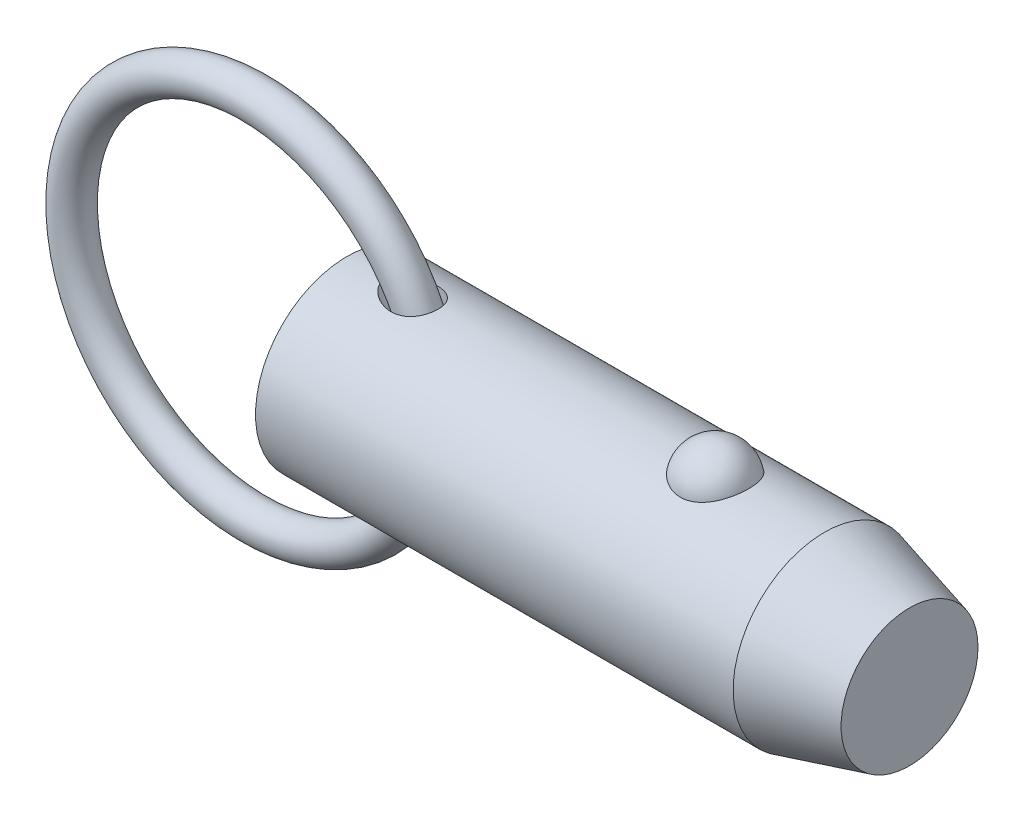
ISO-10303-21;
HEADER;
FILE_DESCRIPTION(('STEP AP214'),'2;1');
FILE_NAME('part.step','',(''),(''),'','','');
FILE_SCHEMA(('AUTOMOTIVE_DESIGN { 1 0 10303 214 1 1 1 1 }'));
ENDSEC;
DATA;
#1=APPLICATION_CONTEXT('core data for automotive mechanical design processes');
#2=APPLICATION_PROTOCOL_DEFINITION('international standard','automotive_design',2000,#1);
#3=PRODUCT_CONTEXT('',#1,'mechanical');
#4=PRODUCT('Part','Part','',(#3));
#5=PRODUCT_RELATED_PRODUCT_CATEGORY('part','',(#4));
#6=PRODUCT_DEFINITION_FORMATION('','',#4);
#7=PRODUCT_DEFINITION_CONTEXT('part definition',#1,'design');
#8=PRODUCT_DEFINITION('design','',#6,#7);
#9=PRODUCT_DEFINITION_SHAPE('','',#8);
#10=(LENGTH_UNIT() NAMED_UNIT(*) SI_UNIT(.MILLI.,.METRE.));
#11=(NAMED_UNIT(*) PLANE_ANGLE_UNIT() SI_UNIT($,.RADIAN.));
#12=(NAMED_UNIT(*) SI_UNIT($,.STERADIAN.) SOLID_ANGLE_UNIT());
#13=UNCERTAINTY_MEASURE_WITH_UNIT(LENGTH_MEASURE(1.E-05),#10,'distance_accuracy_value','');
#14=(GEOMETRIC_REPRESENTATION_CONTEXT(3) GLOBAL_UNCERTAINTY_ASSIGNED_CONTEXT((#13)) GLOBAL_UNIT_ASSIGNED_CONTEXT((#10,
#11,#12)) REPRESENTATION_CONTEXT('',''));
#15=CARTESIAN_POINT('',(0.,0.,0.));
#16=DIRECTION('',(0.,0.,1.));
#17=DIRECTION('',(1.,0.,0.));
#18=AXIS2_PLACEMENT_3D('',#15,#16,#17);
#19=CARTESIAN_POINT('',(-9.66825126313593,0.,0.));
#20=DIRECTION('',(0.,0.,1.));
#21=DIRECTION('',(1.,0.,0.));
#22=AXIS2_PLACEMENT_3D('',#19,#20,#21);
#23=TOROIDAL_SURFACE('',#22,19.05,1.905);
#24=CARTESIAN_POINT('',(11.2867487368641,0.,0.));
#25=VERTEX_POINT('',#24);
#26=VERTEX_LOOP('',#25);
#27=FACE_BOUND('',#26,.T.);
#28=ADVANCED_FACE('P0_F12',(#27),#23,.T.);
#29=CLOSED_SHELL('',(#28));
#30=MANIFOLD_SOLID_BREP('P0_B1',#29);
#31=CARTESIAN_POINT('',(0.,0.,0.));
#32=DIRECTION('',(1.,0.,0.));
#33=DIRECTION('',(0.,0.,-1.));
#34=AXIS2_PLACEMENT_3D('',#31,#32,#33);
#35=CYLINDRICAL_SURFACE('',#34,9.525);
#36=CARTESIAN_POINT('',(4.56693409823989,9.4314194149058,-1.33189820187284));
#37=CARTESIAN_POINT('',(4.70260475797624,9.41020313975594,-1.48215931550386));
#38=CARTESIAN_POINT('',(4.85555680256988,9.38755003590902,-1.61683982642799));
#39=CARTESIAN_POINT('',(5.10171959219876,9.35450554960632,-1.79512943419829));
#40=CARTESIAN_POINT('',(5.18674514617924,9.34362629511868,-1.85068909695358));
#41=CARTESIAN_POINT('',(5.36154389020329,9.32258514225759,-1.95392002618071));
#42=CARTESIAN_POINT('',(5.45131542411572,9.31242299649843,-2.00159402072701));
#43=CARTESIAN_POINT('',(5.70070211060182,9.28632120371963,-2.12033289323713));
#44=CARTESIAN_POINT('',(5.86420408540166,9.27146938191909,-2.18362944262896));
#45=CARTESIAN_POINT('',(6.19893345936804,9.24694163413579,-2.28525783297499));
#46=CARTESIAN_POINT('',(6.3701538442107,9.23726110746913,-2.32361187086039));
#47=CARTESIAN_POINT('',(6.73531776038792,9.22400982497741,-2.37575048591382));
#48=CARTESIAN_POINT('',(6.92975826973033,9.22118808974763,-2.38652934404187));
#49=CARTESIAN_POINT('',(7.21995443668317,9.22416297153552,-2.37494980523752));
#50=CARTESIAN_POINT('',(7.31643847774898,9.22635560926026,-2.366466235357));
#51=CARTESIAN_POINT('',(7.50796421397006,9.2331428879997,-2.33985028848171));
#52=CARTESIAN_POINT('',(7.60300650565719,9.23773650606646,-2.32172202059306));
#53=CARTESIAN_POINT('',(7.83273114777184,9.25183311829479,-2.26504721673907));
#54=CARTESIAN_POINT('',(7.96603028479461,9.26261470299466,-2.2209856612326));
#55=CARTESIAN_POINT('',(8.22310899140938,9.28816519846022,-2.1115730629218));
#56=CARTESIAN_POINT('',(8.34689477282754,9.30293147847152,-2.04623606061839));
#57=CARTESIAN_POINT('',(8.58136049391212,9.3349416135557,-1.89485344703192));
#58=CARTESIAN_POINT('',(8.69199721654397,9.35219324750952,-1.8087422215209));
#59=CARTESIAN_POINT('',(8.89592093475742,9.38707016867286,-1.6179918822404));
#60=CARTESIAN_POINT('',(8.98920771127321,9.40469546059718,-1.51335253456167));
#61=CARTESIAN_POINT('',(9.15057731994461,9.43713590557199,-1.29519427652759));
#62=CARTESIAN_POINT('',(9.21980158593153,9.45205440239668,-1.18253282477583));
#63=CARTESIAN_POINT('',(9.33826736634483,9.47856708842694,-0.946802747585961));
#64=CARTESIAN_POINT('',(9.38751161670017,9.49016173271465,-0.823735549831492));
#65=CARTESIAN_POINT('',(9.46423850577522,9.50859378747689,-0.572614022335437));
#66=CARTESIAN_POINT('',(9.4920239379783,9.5154972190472,-0.444656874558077));
#67=CARTESIAN_POINT('',(9.52636926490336,9.5240690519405,-0.185752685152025));
#68=CARTESIAN_POINT('',(9.5329292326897,9.52573747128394,-0.054805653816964));
#69=CARTESIAN_POINT('',(9.52467276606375,9.52365852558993,0.206503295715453));
#70=CARTESIAN_POINT('',(9.50983454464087,9.51990564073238,0.336864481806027));
#71=CARTESIAN_POINT('',(9.45907362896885,9.50737852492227,0.593166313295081));
#72=CARTESIAN_POINT('',(9.42315106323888,9.49860432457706,0.719106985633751));
#73=CARTESIAN_POINT('',(9.3310664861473,9.4769892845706,0.962959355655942));
#74=CARTESIAN_POINT('',(9.27490839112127,9.46414923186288,1.08087260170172));
#75=CARTESIAN_POINT('',(9.1437580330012,9.43581000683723,1.30534632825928));
#76=CARTESIAN_POINT('',(9.06876720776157,9.42031103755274,1.41190767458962));
#77=CARTESIAN_POINT('',(8.90203187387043,9.38836719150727,1.61069439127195));
#78=CARTESIAN_POINT('',(8.81029913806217,9.371922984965,1.70292975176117));
#79=CARTESIAN_POINT('',(8.6126877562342,9.33985045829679,1.87086859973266));
#80=CARTESIAN_POINT('',(8.50680947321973,9.3242221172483,1.94657251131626));
#81=CARTESIAN_POINT('',(8.28220546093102,9.29513431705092,2.08109032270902));
#82=CARTESIAN_POINT('',(8.16329919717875,9.28171415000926,2.13961034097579));
#83=CARTESIAN_POINT('',(7.91756052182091,9.25859072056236,2.23755716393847));
#84=CARTESIAN_POINT('',(7.79072606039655,9.24888842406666,2.27697900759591));
#85=CARTESIAN_POINT('',(7.52377913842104,9.23338749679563,2.33907806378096));
#86=CARTESIAN_POINT('',(7.3833476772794,9.22789571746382,2.36044900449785));
#87=CARTESIAN_POINT('',(7.1008139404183,9.22210229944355,2.3829751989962));
#88=CARTESIAN_POINT('',(6.95871103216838,9.22180269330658,2.38412253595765));
#89=CARTESIAN_POINT('',(6.65642691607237,9.22632724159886,2.36656230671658));
#90=CARTESIAN_POINT('',(6.49641694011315,9.23185415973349,2.3451317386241));
#91=CARTESIAN_POINT('',(6.18115433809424,9.24811737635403,2.28014143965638));
#92=CARTESIAN_POINT('',(6.02590710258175,9.25885936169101,2.23655754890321));
#93=CARTESIAN_POINT('',(5.69904720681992,9.28624254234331,2.12025087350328));
#94=CARTESIAN_POINT('',(5.52873601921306,9.30354853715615,2.04400672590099));
#95=CARTESIAN_POINT('',(5.20289495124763,9.34106989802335,1.86504730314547));
#96=CARTESIAN_POINT('',(5.0473596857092,9.36128419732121,1.76234172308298));
#97=CARTESIAN_POINT('',(4.79287124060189,9.39697639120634,1.55895334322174));
#98=CARTESIAN_POINT('',(4.6893870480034,9.41240250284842,1.46392900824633));
#99=CARTESIAN_POINT('',(4.4984714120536,9.44202586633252,1.25875918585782));
#100=CARTESIAN_POINT('',(4.41101129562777,9.45622528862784,1.1486413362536));
#101=CARTESIAN_POINT('',(4.27502257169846,9.47888210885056,0.94060098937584));
#102=CARTESIAN_POINT('',(4.22216329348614,9.48791121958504,0.845586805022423));
#103=CARTESIAN_POINT('',(4.13241478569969,9.50344321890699,0.648051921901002));
#104=CARTESIAN_POINT('',(4.09551182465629,9.50994827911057,0.545537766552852));
#105=CARTESIAN_POINT('',(4.04043124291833,9.51971586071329,0.334452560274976));
#106=CARTESIAN_POINT('',(4.0224072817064,9.52295176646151,0.225839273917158));
#107=CARTESIAN_POINT('',(4.00750873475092,9.52562364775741,0.00713006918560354));
#108=CARTESIAN_POINT('',(4.01062334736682,9.52506156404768,-0.102965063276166));
#109=CARTESIAN_POINT('',(4.03592967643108,9.52053221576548,-0.306944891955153));
#110=CARTESIAN_POINT('',(4.05571676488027,9.51699426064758,-0.401151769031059));
#111=CARTESIAN_POINT('',(4.10967975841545,9.5074546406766,-0.585176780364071));
#112=CARTESIAN_POINT('',(4.14385995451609,9.50145224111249,-0.674993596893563));
#113=CARTESIAN_POINT('',(4.23261356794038,9.48611703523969,-0.866116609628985));
#114=CARTESIAN_POINT('',(4.28990016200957,9.47635800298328,-0.966121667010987));
#115=CARTESIAN_POINT('',(4.4185657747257,9.45502867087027,-1.15640011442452));
#116=CARTESIAN_POINT('',(4.48996918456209,9.44345524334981,-1.24665623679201));
#117=CARTESIAN_POINT('',(4.56693409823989,9.4314194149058,-1.33189820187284));
#118=B_SPLINE_CURVE_WITH_KNOTS('',3,(#36,#37,#38,#39,#40,#41,#42,#43,#44,#45,#46,#47,#48,#49,
#50,#51,#52,#53,#54,#55,#56,#57,#58,#59,#60,#61,#62,#63,#64,#65,#66,#67,#68,#69,#70,#71,#72,#73,
#74,#75,#76,#77,#78,#79,#80,#81,#82,#83,#84,#85,#86,#87,#88,#89,#90,#91,#92,#93,#94,#95,#96,#97,
#98,#99,#100,#101,#102,#103,#104,#105,#106,#107,#108,#109,#110,#111,#112,#113,#114,#115,#116,
#117),.UNSPECIFIED.,.T.,.F.,(4,2,2,2,2,2,2,2,2,2,2,2,2,2,2,2,2,2,2,2,2,2,2,2,2,2,2,2,2,2,2,2,2,
2,2,2,2,2,2,2,4),(0.,0.609951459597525,0.916123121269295,1.22218863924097,1.74791337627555,
2.27316961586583,2.85362722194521,3.14383229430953,3.43391382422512,3.85437497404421,
4.27455920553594,4.69608835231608,5.11762282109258,5.51490051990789,5.91212379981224,
6.30363414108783,6.69514313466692,7.0870510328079,7.47895654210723,7.87078624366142,
8.26258603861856,8.65411137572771,9.0456266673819,9.44349251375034,9.84146165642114,
10.2662286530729,10.6911619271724,11.1739180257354,11.6572017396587,12.2170157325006,
12.776624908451,13.1992556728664,13.6211226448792,13.9471990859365,14.2729943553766,
14.6014211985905,14.9296802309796,15.2173810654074,15.505167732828,15.8505863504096,
16.1966070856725),.UNSPECIFIED.);
#119=CARTESIAN_POINT('',(4.56693409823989,9.4314194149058,-1.33189820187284));
#120=VERTEX_POINT('',#119);
#121=EDGE_CURVE('P1_E40',#120,#120,#118,.T.);
#122=ORIENTED_EDGE('',*,*,#121,.T.);
#123=EDGE_LOOP('',(#122));
#124=FACE_BOUND('',#123,.T.);
#125=CARTESIAN_POINT('',(49.8430540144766,0.,0.));
#126=DIRECTION('',(1.,0.,0.));
#127=DIRECTION('',(0.,0.,-1.));
#128=AXIS2_PLACEMENT_3D('',#125,#126,#127);
#129=CIRCLE('',#128,9.525);
#130=CARTESIAN_POINT('',(49.8430540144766,0.,-9.525));
#131=VERTEX_POINT('',#130);
#132=EDGE_CURVE('P1_E25',#131,#131,#129,.T.);
#133=ORIENTED_EDGE('',*,*,#132,.F.);
#134=EDGE_LOOP('',(#133));
#135=FACE_BOUND('',#134,.T.);
#136=CARTESIAN_POINT('',(0.,0.,0.));
#137=DIRECTION('',(1.,0.,0.));
#138=DIRECTION('',(0.,0.,-1.));
#139=AXIS2_PLACEMENT_3D('',#136,#137,#138);
#140=CIRCLE('',#139,9.525);
#141=CARTESIAN_POINT('',(0.,0.,-9.525));
#142=VERTEX_POINT('',#141);
#143=EDGE_CURVE('P1_E9',#142,#142,#140,.T.);
#144=ORIENTED_EDGE('',*,*,#143,.T.);
#145=EDGE_LOOP('',(#144));
#146=FACE_BOUND('',#145,.T.);
#147=CARTESIAN_POINT('',(38.4457573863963,8.80405803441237,3.63513233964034));
#148=CARTESIAN_POINT('',(38.3516766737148,8.80405953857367,3.63513053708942));
#149=CARTESIAN_POINT('',(38.2575618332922,8.80561325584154,3.63137461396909));
#150=CARTESIAN_POINT('',(38.0700126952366,8.81177748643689,3.61638665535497));
#151=CARTESIAN_POINT('',(37.9765788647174,8.81638992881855,3.60514990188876));
#152=CARTESIAN_POINT('',(37.6979452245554,8.8346711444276,3.56024627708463));
#153=CARTESIAN_POINT('',(37.5146916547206,8.85278327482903,3.51538626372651));
#154=CARTESIAN_POINT('',(37.159509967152,8.89871214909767,3.39742145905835));
#155=CARTESIAN_POINT('',(36.9875533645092,8.92650327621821,3.32439116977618));
#156=CARTESIAN_POINT('',(36.658707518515,8.98874819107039,3.15220244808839));
#157=CARTESIAN_POINT('',(36.5018114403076,9.02319893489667,3.05305594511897));
#158=CARTESIAN_POINT('',(36.2022147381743,9.09629186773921,2.82797815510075));
#159=CARTESIAN_POINT('',(36.0600600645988,9.13502685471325,2.70135138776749));
#160=CARTESIAN_POINT('',(35.7982999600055,9.2118657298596,2.42641932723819));
#161=CARTESIAN_POINT('',(35.6787015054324,9.24996941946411,2.27810735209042));
#162=CARTESIAN_POINT('',(35.459645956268,9.32341082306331,1.95652290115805));
#163=CARTESIAN_POINT('',(35.3613174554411,9.35855090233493,1.78243511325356));
#164=CARTESIAN_POINT('',(35.1938190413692,9.42045142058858,1.41937246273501));
#165=CARTESIAN_POINT('',(35.1246511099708,9.44721128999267,1.23039658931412));
#166=CARTESIAN_POINT('',(35.0161994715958,9.48990641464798,0.84037088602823));
#167=CARTESIAN_POINT('',(34.9772880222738,9.50570658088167,0.639202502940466));
#168=CARTESIAN_POINT('',(34.9315550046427,9.52433146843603,0.232664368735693));
#169=CARTESIAN_POINT('',(34.9247324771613,9.52715657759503,0.0272947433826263));
#170=CARTESIAN_POINT('',(34.943255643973,9.51956918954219,-0.380478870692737));
#171=CARTESIAN_POINT('',(34.9684052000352,9.50923740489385,-0.58289331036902));
#172=CARTESIAN_POINT('',(35.05002537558,9.47651897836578,-0.980293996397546));
#173=CARTESIAN_POINT('',(35.1064966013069,9.45413210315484,-1.17528009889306));
#174=CARTESIAN_POINT('',(35.2497192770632,9.39954044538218,-1.55263697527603));
#175=CARTESIAN_POINT('',(35.3365124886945,9.36732213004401,-1.73498993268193));
#176=CARTESIAN_POINT('',(35.5386103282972,9.29640700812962,-2.08177763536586));
#177=CARTESIAN_POINT('',(35.6539172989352,9.25770966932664,-2.24621090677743));
#178=CARTESIAN_POINT('',(35.911264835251,9.17775604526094,-2.5533833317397));
#179=CARTESIAN_POINT('',(36.0534344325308,9.136488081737,-2.696011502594));
#180=CARTESIAN_POINT('',(36.36089985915,9.05620497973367,-2.95451229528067));
#181=CARTESIAN_POINT('',(36.526193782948,9.01718965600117,-3.07038711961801));
#182=CARTESIAN_POINT('',(36.872052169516,8.94680019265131,-3.26976836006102));
#183=CARTESIAN_POINT('',(37.0522278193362,8.91528408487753,-3.353897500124));
#184=CARTESIAN_POINT('',(37.4256514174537,8.86272514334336,-3.49043503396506));
#185=CARTESIAN_POINT('',(37.6188944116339,8.84167836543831,-3.54285537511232));
#186=CARTESIAN_POINT('',(38.0025036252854,8.81348056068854,-3.61241306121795));
#187=CARTESIAN_POINT('',(38.1925251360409,8.80568348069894,-3.63119339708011));
#188=CARTESIAN_POINT('',(38.5731906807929,8.80289410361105,-3.63795342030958));
#189=CARTESIAN_POINT('',(38.7638345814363,8.80789922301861,-3.62593932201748));
#190=CARTESIAN_POINT('',(39.134007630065,8.82974915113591,-3.57238430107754));
#191=CARTESIAN_POINT('',(39.3136976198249,8.84621463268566,-3.53178890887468));
#192=CARTESIAN_POINT('',(39.6634226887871,8.88875330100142,-3.42331083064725));
#193=CARTESIAN_POINT('',(39.8334569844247,8.91482726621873,-3.35542593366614));
#194=CARTESIAN_POINT('',(40.1632377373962,8.97448239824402,-3.19248225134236));
#195=CARTESIAN_POINT('',(40.3226801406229,9.00821446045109,-3.09686474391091));
#196=CARTESIAN_POINT('',(40.6235136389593,9.07935398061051,-2.88162736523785));
#197=CARTESIAN_POINT('',(40.7649005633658,9.11676228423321,-2.76200196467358));
#198=CARTESIAN_POINT('',(41.0333193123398,9.19347419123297,-2.49516285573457));
#199=CARTESIAN_POINT('',(41.1592750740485,9.23277872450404,-2.34686614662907));
#200=CARTESIAN_POINT('',(41.3855227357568,9.30737610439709,-2.03093683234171));
#201=CARTESIAN_POINT('',(41.4858100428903,9.34266823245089,-1.86330077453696));
#202=CARTESIAN_POINT('',(41.6615149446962,9.40674710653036,-1.50744893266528));
#203=CARTESIAN_POINT('',(41.736041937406,9.43529176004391,-1.31874876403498));
#204=CARTESIAN_POINT('',(41.8541650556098,9.48144132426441,-0.930631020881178));
#205=CARTESIAN_POINT('',(41.8977608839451,9.49904612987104,-0.731213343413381));
#206=CARTESIAN_POINT('',(41.9531580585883,9.5215314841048,-0.32714729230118));
#207=CARTESIAN_POINT('',(41.9649354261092,9.52640243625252,-0.122495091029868));
#208=CARTESIAN_POINT('',(41.9563825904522,9.5228957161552,0.286018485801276));
#209=CARTESIAN_POINT('',(41.9360530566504,9.5145183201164,0.489879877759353));
#210=CARTESIAN_POINT('',(41.8638840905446,9.48544083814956,0.889994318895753));
#211=CARTESIAN_POINT('',(41.8121993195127,9.46480124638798,1.08627971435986));
#212=CARTESIAN_POINT('',(41.6784917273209,9.4133389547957,1.46682086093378));
#213=CARTESIAN_POINT('',(41.5964668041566,9.38251554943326,1.65107577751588));
#214=CARTESIAN_POINT('',(41.4031929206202,9.31365636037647,2.00346348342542));
#215=CARTESIAN_POINT('',(41.2917838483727,9.27558138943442,2.17150083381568));
#216=CARTESIAN_POINT('',(41.0422947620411,9.19638714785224,2.48563115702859));
#217=CARTESIAN_POINT('',(40.9042163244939,9.15526805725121,2.63172542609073));
#218=CARTESIAN_POINT('',(40.6048438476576,9.07465393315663,2.89750997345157));
#219=CARTESIAN_POINT('',(40.4436109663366,9.03515496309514,3.01726776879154));
#220=CARTESIAN_POINT('',(40.1016136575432,8.96227564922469,3.22732920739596));
#221=CARTESIAN_POINT('',(39.920841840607,8.92889763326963,3.31762165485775));
#222=CARTESIAN_POINT('',(39.5514451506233,8.8734538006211,3.46314419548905));
#223=CARTESIAN_POINT('',(39.3633237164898,8.85102983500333,3.51950082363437));
#224=CARTESIAN_POINT('',(39.0757869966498,8.8266696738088,3.57993683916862));
#225=CARTESIAN_POINT('',(38.9791339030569,8.82009725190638,3.59606217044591));
#226=CARTESIAN_POINT('',(38.7846770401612,8.81020897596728,3.62022512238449));
#227=CARTESIAN_POINT('',(38.6868741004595,8.80689090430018,3.62826825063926));
#228=CARTESIAN_POINT('',(38.5412243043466,8.80445615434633,3.63416760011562));
#229=CARTESIAN_POINT('',(38.4934952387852,8.80405727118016,3.63513325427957));
#230=CARTESIAN_POINT('',(38.4457573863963,8.80405803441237,3.63513233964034));
#231=B_SPLINE_CURVE_WITH_KNOTS('',3,(#147,#148,#149,#150,#151,#152,#153,#154,#155,#156,#157,
#158,#159,#160,#161,#162,#163,#164,#165,#166,#167,#168,#169,#170,#171,#172,#173,#174,#175,#176,
#177,#178,#179,#180,#181,#182,#183,#184,#185,#186,#187,#188,#189,#190,#191,#192,#193,#194,#195,
#196,#197,#198,#199,#200,#201,#202,#203,#204,#205,#206,#207,#208,#209,#210,#211,#212,#213,#214,
#215,#216,#217,#218,#219,#220,#221,#222,#223,#224,#225,#226,#227,#228,#229,#230),.UNSPECIFIED.,
.T.,.F.,(4,2,2,2,2,2,2,2,2,2,2,2,2,2,2,2,2,2,2,2,2,2,2,2,2,2,2,2,2,2,2,2,2,2,2,2,2,2,2,2,2,4),
(0.,0.282202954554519,0.564584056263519,1.13017050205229,1.69427128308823,2.25811483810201,
2.83836627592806,3.41879688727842,4.02497117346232,4.63118665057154,5.24474754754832,
5.85829010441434,6.46808687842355,7.07789545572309,7.68854723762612,8.29924920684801,
8.91296283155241,9.52662591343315,10.1275338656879,10.7282152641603,11.2986646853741,
11.868998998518,12.4213015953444,12.973648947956,13.5380053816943,14.1024919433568,
14.695298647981,15.2882113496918,15.8999469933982,16.5116885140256,17.1238909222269,
17.7360805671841,18.3452748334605,18.9545113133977,19.567138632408,20.179729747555,
20.7907316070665,21.4019653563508,21.9915938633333,22.2859053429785,22.5800161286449,
22.723209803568),.UNSPECIFIED.);
#232=CARTESIAN_POINT('',(38.4457573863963,8.80405803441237,3.63513233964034));
#233=VERTEX_POINT('',#232);
#234=EDGE_CURVE('P1_E34',#233,#233,#231,.T.);
#235=ORIENTED_EDGE('',*,*,#234,.T.);
#236=EDGE_LOOP('',(#235));
#237=FACE_BOUND('',#236,.T.);
#238=CARTESIAN_POINT('',(4.56693409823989,-9.4314194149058,-1.33189820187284));
#239=CARTESIAN_POINT('',(4.48932984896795,-9.4435553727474,-1.24594548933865));
#240=CARTESIAN_POINT('',(4.41737309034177,-9.45522193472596,-1.1548795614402));
#241=CARTESIAN_POINT('',(4.2878104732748,-9.47670896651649,-0.962782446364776));
#242=CARTESIAN_POINT('',(4.23019403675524,-9.48653079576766,-0.861758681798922));
#243=CARTESIAN_POINT('',(4.13254559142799,-9.5034118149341,-0.649723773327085));
#244=CARTESIAN_POINT('',(4.09271158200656,-9.51043980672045,-0.538615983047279));
#245=CARTESIAN_POINT('',(4.04973167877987,-9.51806966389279,-0.367764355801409));
#246=CARTESIAN_POINT('',(4.03820037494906,-9.52012756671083,-0.310118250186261));
#247=CARTESIAN_POINT('',(4.02100287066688,-9.52320274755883,-0.193935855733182));
#248=CARTESIAN_POINT('',(4.01533565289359,-9.52422020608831,-0.135399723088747));
#249=CARTESIAN_POINT('',(4.0081707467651,-9.52550497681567,0.0247266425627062));
#250=CARTESIAN_POINT('',(4.01270492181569,-9.52468821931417,0.126661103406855));
#251=CARTESIAN_POINT('',(4.03954973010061,-9.51988506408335,0.328012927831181));
#252=CARTESIAN_POINT('',(4.06186450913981,-9.51589792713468,0.427429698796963));
#253=CARTESIAN_POINT('',(4.12088980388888,-9.50548528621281,0.616362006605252));
#254=CARTESIAN_POINT('',(4.15684838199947,-9.49918763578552,0.706123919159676));
#255=CARTESIAN_POINT('',(4.24094647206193,-9.48470618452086,0.879522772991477));
#256=CARTESIAN_POINT('',(4.28909090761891,-9.47652162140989,0.963157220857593));
#257=CARTESIAN_POINT('',(4.42295891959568,-9.45426317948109,1.16513741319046));
#258=CARTESIAN_POINT('',(4.51523752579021,-9.43933320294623,1.27905352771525));
#259=CARTESIAN_POINT('',(4.71682295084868,-9.40825940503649,1.49055892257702));
#260=CARTESIAN_POINT('',(4.82617286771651,-9.39211256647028,1.58810554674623));
#261=CARTESIAN_POINT('',(5.09064226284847,-9.35555264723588,1.79246125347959));
#262=CARTESIAN_POINT('',(5.2499041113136,-9.33524115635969,1.89393122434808));
#263=CARTESIAN_POINT('',(5.58309255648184,-9.29785396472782,2.06968659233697));
#264=CARTESIAN_POINT('',(5.7570289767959,-9.28078045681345,2.14395359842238));
#265=CARTESIAN_POINT('',(6.11646882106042,-9.25213303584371,2.26440412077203));
#266=CARTESIAN_POINT('',(6.30205582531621,-9.2406056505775,2.31035092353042));
#267=CARTESIAN_POINT('',(6.67856093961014,-9.22541807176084,2.37029728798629));
#268=CARTESIAN_POINT('',(6.8694704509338,-9.2217458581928,2.3843456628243));
#269=CARTESIAN_POINT('',(7.21217144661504,-9.2234423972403,2.37775005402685));
#270=CARTESIAN_POINT('',(7.36409439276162,-9.22713860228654,2.36352577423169));
#271=CARTESIAN_POINT('',(7.66346227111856,-9.24048072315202,2.31082299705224));
#272=CARTESIAN_POINT('',(7.81090958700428,-9.25012341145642,2.27235765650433));
#273=CARTESIAN_POINT('',(8.09730316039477,-9.2746609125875,2.17003648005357));
#274=CARTESIAN_POINT('',(8.23619652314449,-9.28958517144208,2.10603803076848));
#275=CARTESIAN_POINT('',(8.49918675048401,-9.32290326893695,1.95324442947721));
#276=CARTESIAN_POINT('',(8.62328895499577,-9.34129584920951,1.86445826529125));
#277=CARTESIAN_POINT('',(8.84006515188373,-9.37706953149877,1.67466761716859));
#278=CARTESIAN_POINT('',(8.93465172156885,-9.39436331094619,1.57582357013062));
#279=CARTESIAN_POINT('',(9.1049023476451,-9.42761680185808,1.362809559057));
#280=CARTESIAN_POINT('',(9.18057146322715,-9.44357686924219,1.24864370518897));
#281=CARTESIAN_POINT('',(9.30789178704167,-9.47159985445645,1.01379272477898));
#282=CARTESIAN_POINT('',(9.36045544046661,-9.48380365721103,0.893617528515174));
#283=CARTESIAN_POINT('',(9.44498362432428,-9.50388751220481,0.645890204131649));
#284=CARTESIAN_POINT('',(9.47694947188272,-9.51176784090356,0.518338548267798));
#285=CARTESIAN_POINT('',(9.51944262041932,-9.52232073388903,0.260103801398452));
#286=CARTESIAN_POINT('',(9.53006646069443,-9.52501674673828,0.129437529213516));
#287=CARTESIAN_POINT('',(9.52993291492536,-9.52498309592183,-0.131885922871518));
#288=CARTESIAN_POINT('',(9.5191752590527,-9.52225336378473,-0.262543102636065));
#289=CARTESIAN_POINT('',(9.47648788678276,-9.51165418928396,-0.520312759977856));
#290=CARTESIAN_POINT('',(9.44453086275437,-9.50377811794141,-0.647420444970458));
#291=CARTESIAN_POINT('',(9.36015568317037,-9.48373425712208,-0.894290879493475));
#292=CARTESIAN_POINT('',(9.30773827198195,-9.47156662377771,-1.01405389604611));
#293=CARTESIAN_POINT('',(9.18380895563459,-9.44428888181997,-1.24269386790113));
#294=CARTESIAN_POINT('',(9.11232064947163,-9.42918241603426,-1.35158405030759));
#295=CARTESIAN_POINT('',(8.95212687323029,-9.39767706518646,-1.55562459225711));
#296=CARTESIAN_POINT('',(8.86342281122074,-9.3812782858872,-1.65077607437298));
#297=CARTESIAN_POINT('',(8.6710444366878,-9.34891827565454,-1.8251751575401));
#298=CARTESIAN_POINT('',(8.56732858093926,-9.33295841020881,-1.90437711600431));
#299=CARTESIAN_POINT('',(8.34818438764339,-9.30317889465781,-2.0449122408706));
#300=CARTESIAN_POINT('',(8.23275529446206,-9.28935938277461,-2.10624425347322));
#301=CARTESIAN_POINT('',(7.98961240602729,-9.26475003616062,-2.2120340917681));
#302=CARTESIAN_POINT('',(7.86162088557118,-9.25407358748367,-2.25587700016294));
#303=CARTESIAN_POINT('',(7.60027499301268,-9.23720810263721,-2.32397032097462));
#304=CARTESIAN_POINT('',(7.46691858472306,-9.23102078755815,-2.34821321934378));
#305=CARTESIAN_POINT('',(7.18516230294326,-9.22302718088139,-2.37943079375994));
#306=CARTESIAN_POINT('',(7.03654454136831,-9.22169704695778,-2.38452997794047));
#307=CARTESIAN_POINT('',(6.7401504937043,-9.22442327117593,-2.37395141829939));
#308=CARTESIAN_POINT('',(6.59237455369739,-9.22848170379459,-2.35826567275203));
#309=CARTESIAN_POINT('',(6.27762777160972,-9.2422287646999,-2.30385559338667));
#310=CARTESIAN_POINT('',(6.11124715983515,-9.25269504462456,-2.26192683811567));
#311=CARTESIAN_POINT('',(5.78635920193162,-9.27830776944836,-2.15445569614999));
#312=CARTESIAN_POINT('',(5.62786567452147,-9.29346211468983,-2.08887341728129));
#313=CARTESIAN_POINT('',(5.39013065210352,-9.31931237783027,-1.96924953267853));
#314=CARTESIAN_POINT('',(5.30683088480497,-9.32901725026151,-1.92292485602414));
#315=CARTESIAN_POINT('',(5.1445580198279,-9.34899035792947,-1.82334419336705));
#316=CARTESIAN_POINT('',(5.06558607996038,-9.35925874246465,-1.77008636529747));
#317=CARTESIAN_POINT('',(4.83670950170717,-9.39034445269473,-1.60010986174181));
#318=CARTESIAN_POINT('',(4.69422471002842,-9.41151337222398,-1.47288240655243));
#319=CARTESIAN_POINT('',(4.56693409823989,-9.4314194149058,-1.33189820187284));
#320=B_SPLINE_CURVE_WITH_KNOTS('',3,(#238,#239,#240,#241,#242,#243,#244,#245,#246,#247,#248,
#249,#250,#251,#252,#253,#254,#255,#256,#257,#258,#259,#260,#261,#262,#263,#264,#265,#266,#267,
#268,#269,#270,#271,#272,#273,#274,#275,#276,#277,#278,#279,#280,#281,#282,#283,#284,#285,#286,
#287,#288,#289,#290,#291,#292,#293,#294,#295,#296,#297,#298,#299,#300,#301,#302,#303,#304,#305,
#306,#307,#308,#309,#310,#311,#312,#313,#314,#315,#316,#317,#318,#319),.UNSPECIFIED.,.T.,.F.,(4,
2,2,2,2,2,2,2,2,2,2,2,2,2,2,2,2,2,2,2,2,2,2,2,2,2,2,2,2,2,2,2,2,2,2,2,2,2,2,2,4),(0.,
0.348900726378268,0.697543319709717,1.0499765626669,1.22617690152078,1.40234666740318,
1.70666745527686,2.01105922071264,2.30066493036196,2.59038784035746,3.03001384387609,
3.4707682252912,4.03766594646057,4.60494622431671,5.17690598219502,5.74798989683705,
6.20400848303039,6.65977977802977,7.11813321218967,7.57632066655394,7.98791759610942,
8.39940433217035,8.79273459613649,9.18603970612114,9.57756168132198,9.96908859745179,
10.3611208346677,10.7531388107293,11.1446739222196,11.536177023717,11.9287850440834,
12.3214184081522,12.7268448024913,13.1324265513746,13.5768390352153,14.0214226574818,
14.5351685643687,15.0497849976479,15.3368801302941,15.6240516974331,16.1963372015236),.UNSPECIFIED.);
#321=CARTESIAN_POINT('',(4.56693409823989,-9.4314194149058,-1.33189820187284));
#322=VERTEX_POINT('',#321);
#323=EDGE_CURVE('P1_E17',#322,#322,#320,.T.);
#324=ORIENTED_EDGE('',*,*,#323,.T.);
#325=EDGE_LOOP('',(#324));
#326=FACE_BOUND('',#325,.T.);
#327=ADVANCED_FACE('P1_F13',(#124,#135,#146,#237,#326),#35,.T.);
#328=CARTESIAN_POINT('',(0.,0.,0.));
#329=DIRECTION('',(-1.,0.,0.));
#330=DIRECTION('',(0.,0.,1.));
#331=AXIS2_PLACEMENT_3D('',#328,#329,#330);
#332=PLANE('',#331);
#333=ORIENTED_EDGE('',*,*,#143,.F.);
#334=EDGE_LOOP('',(#333));
#335=FACE_BOUND('',#334,.T.);
#336=ADVANCED_FACE('P1_F15',(#335),#332,.T.);
#337=CARTESIAN_POINT('',(58.73,0.,0.));
#338=DIRECTION('',(-1.,0.,0.));
#339=DIRECTION('',(0.,0.,1.));
#340=AXIS2_PLACEMENT_3D('',#337,#338,#339);
#341=CONICAL_SURFACE('',#340,7.14375000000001,0.261799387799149);
#342=ORIENTED_EDGE('',*,*,#132,.T.);
#343=EDGE_LOOP('',(#342));
#344=FACE_BOUND('',#343,.T.);
#345=CARTESIAN_POINT('',(58.73,0.,0.));
#346=DIRECTION('',(1.,0.,0.));
#347=DIRECTION('',(0.,0.,-1.));
#348=AXIS2_PLACEMENT_3D('',#345,#346,#347);
#349=CIRCLE('',#348,7.14375000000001);
#350=CARTESIAN_POINT('',(58.73,0.,-7.14375000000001));
#351=VERTEX_POINT('',#350);
#352=EDGE_CURVE('P1_E30',#351,#351,#349,.T.);
#353=ORIENTED_EDGE('',*,*,#352,.F.);
#354=EDGE_LOOP('',(#353));
#355=FACE_BOUND('',#354,.T.);
#356=ADVANCED_FACE('P1_F55',(#344,#355),#341,.T.);
#357=CARTESIAN_POINT('',(58.73,7.14375000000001,0.));
#358=DIRECTION('',(1.,0.,0.));
#359=DIRECTION('',(0.,0.,-1.));
#360=AXIS2_PLACEMENT_3D('',#357,#358,#359);
#361=PLANE('',#360);
#362=ORIENTED_EDGE('',*,*,#352,.T.);
#363=EDGE_LOOP('',(#362));
#364=FACE_BOUND('',#363,.T.);
#365=ADVANCED_FACE('P1_F51',(#364),#361,.T.);
#366=CARTESIAN_POINT('',(38.4457573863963,8.5725,0.));
#367=DIRECTION('',(-1.,0.,0.));
#368=DIRECTION('',(0.,1.,0.));
#369=AXIS2_PLACEMENT_3D('',#366,#367,#368);
#370=SPHERICAL_SURFACE('',#369,3.6425);
#371=ORIENTED_EDGE('',*,*,#234,.F.);
#372=EDGE_LOOP('',(#371));
#373=FACE_BOUND('',#372,.T.);
#374=ADVANCED_FACE('P1_F46',(#373),#370,.T.);
#375=CARTESIAN_POINT('',(-9.66825126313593,0.,0.));
#376=DIRECTION('',(0.,0.,1.));
#377=DIRECTION('',(1.,0.,0.));
#378=AXIS2_PLACEMENT_3D('',#375,#376,#377);
#379=TOROIDAL_SURFACE('',#378,19.05,2.38125);
#380=ORIENTED_EDGE('',*,*,#323,.F.);
#381=EDGE_LOOP('',(#380));
#382=FACE_BOUND('',#381,.T.);
#383=ORIENTED_EDGE('',*,*,#121,.F.);
#384=EDGE_LOOP('',(#383));
#385=FACE_BOUND('',#384,.T.);
#386=ADVANCED_FACE('P1_F50',(#382,#385),#379,.F.);
#387=CLOSED_SHELL('',(#327,#336,#356,#365,#374,#386));
#388=MANIFOLD_SOLID_BREP('P1_B1',#387);
#389=ADVANCED_BREP_SHAPE_REPRESENTATION('',(#18,#30,#388),#14);
#390=SHAPE_DEFINITION_REPRESENTATION(#9,#389);
ENDSEC;
END-ISO-10303-21;
